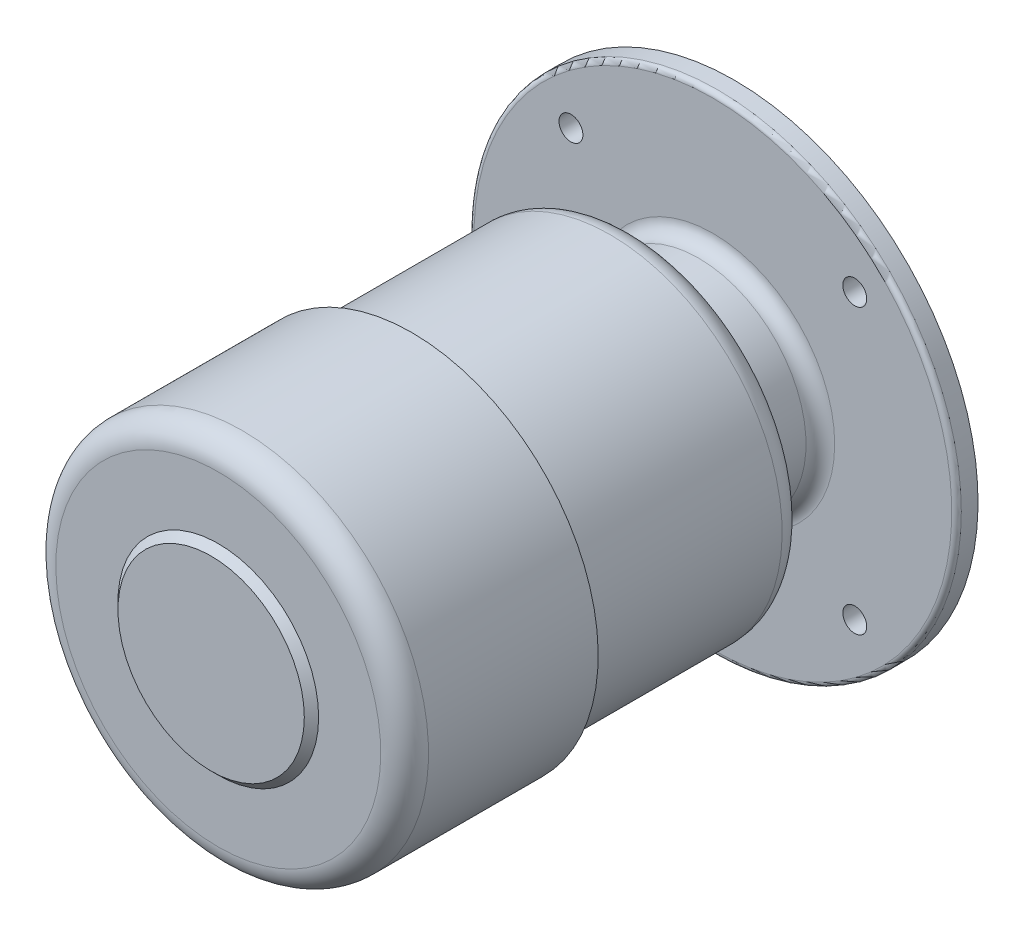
from build123d import *

# Parameters (mm, degrees)
ESQUISSE2_R                      = 66
EXTRUSION1_DEPTH                 = 6
EXTRUSION2_DEPTH                 = 36
ESQUISSE4_R                      = 42
EXTRUSION3_DEPTH                 = 3
EXTRUSION3_TAPER                 = 45
DIAM_TRE_DU_PER_AGE_M10_0_10_1_D = 10
DIAM_TRE_DU_PER_AGE_M10_0_10_2_D = 10
DIAM_TRE_DU_PER_AGE_M10_0_10_3_D = 10
DIAM_TRE_DU_PER_AGE_M10_0_10_4_D = 10
CHANFREIN1_SIZE                  = 2
CONG_1_R                         = 2
CONG_2_R                         = 6
CONG_3_R                         = 6
CONG_4_R                         = 10
CONG_5_R                         = 10


with BuildPart() as part:
    # Esquisse1 → R_volution1 (revolve)
    with BuildSketch(Plane.XZ, mode=Mode.PRIVATE) as r_volution1_sk:
        Polygon((78, 226), (0, 226), (0, 10), (102, 10), (102, 19), (45, 19), (45, 52), (72, 52), (72, 145), (78, 145), align=None)
    revolve(r_volution1_sk.sketch.rotate(Axis((0, 0, 226), (0, 0, -1)), 270), axis=Axis((0, 0, 226), (0, 0, -1)))

    # Esquisse2 → Extrusion1 (add)
    with BuildSketch(Plane(origin=(0, 0, 10), x_dir=(-1, 0, 0), z_dir=(0, 0, -1))):
        with Locations(Location((0, 0, 0), (0, 0, 90))):
            Circle(ESQUISSE2_R)
    extrude(amount=EXTRUSION1_DEPTH)

    # Esquisse3 → Extrusion2 (add)
    with BuildSketch(Plane(origin=(0, 0, 4), x_dir=(-1, 0, 0), z_dir=(0, 0, -1))):
        with BuildLine():
            Line((6.363961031, 2.121320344), (10.337158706, 6.094518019))
            ThreePointArc((10.337158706, 6.094518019), (-8.485281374, -8.485281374), (6.094518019, 10.337158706))
            Line((6.094518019, 10.337158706), (2.121320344, 6.363961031))
            Line((2.121320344, 6.363961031), (6.363961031, 2.121320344))
        make_face()
    extrude(amount=EXTRUSION2_DEPTH)

    # Esquisse4 → Extrusion3 (add)
    with BuildSketch(Plane.XY.offset(226)):
        Circle(ESQUISSE4_R)
    extrude(amount=EXTRUSION3_DEPTH, taper=EXTRUSION3_TAPER)

    # Diam_tre du per_age M10.0 _10_1 (through all)
    with Locations(Plane.XY.offset(19)):
        with Locations((59.39696962, -59.39696962)):
            Hole(DIAM_TRE_DU_PER_AGE_M10_0_10_1_D / 2)

    # Diam_tre du per_age M10.0 _10_2 (through all)
    with Locations(Plane.XY.offset(19)):
        with Locations((59.39696962, 59.39696962)):
            Hole(DIAM_TRE_DU_PER_AGE_M10_0_10_2_D / 2)

    # Diam_tre du per_age M10.0 _10_3 (through all)
    with Locations(Plane.XY.offset(19)):
        with Locations((-59.39696962, -59.39696962)):
            Hole(DIAM_TRE_DU_PER_AGE_M10_0_10_3_D / 2)

    # Diam_tre du per_age M10.0 _10_4 (through all)
    with Locations(Plane.XY.offset(19)):
        with Locations((-59.39696962, 59.39696962)):
            Hole(DIAM_TRE_DU_PER_AGE_M10_0_10_4_D / 2)

    # Chanfrein1
    chanfrein1_edges = [part.edges().sort_by_distance(p)[0] for p in [
        (8.485281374, -8.485281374, -32),
    ]]
    chamfer(chanfrein1_edges, length=CHANFREIN1_SIZE)

    # Cong_1
    cong_1_edges = [part.edges().sort_by_distance(p)[0] for p in [
        (0, -102, 19),
    ]]
    fillet(cong_1_edges, radius=CONG_1_R)

    # Cong_2
    cong_2_edges = [part.edges().sort_by_distance(p)[0] for p in [
        (0, -45, 52),
    ]]
    fillet(cong_2_edges, radius=CONG_2_R)

    # Cong_3
    cong_3_edges = [part.edges().sort_by_distance(p)[0] for p in [
        (0, -45, 19),
    ]]
    fillet(cong_3_edges, radius=CONG_3_R)

    # Cong_4
    cong_4_edges = [part.edges().sort_by_distance(p)[0] for p in [
        (0, -72, 52),
    ]]
    fillet(cong_4_edges, radius=CONG_4_R)

    # Cong_5
    cong_5_edges = [part.edges().sort_by_distance(p)[0] for p in [
        (0, -78, 226),
    ]]
    fillet(cong_5_edges, radius=CONG_5_R)


solid = part.part
